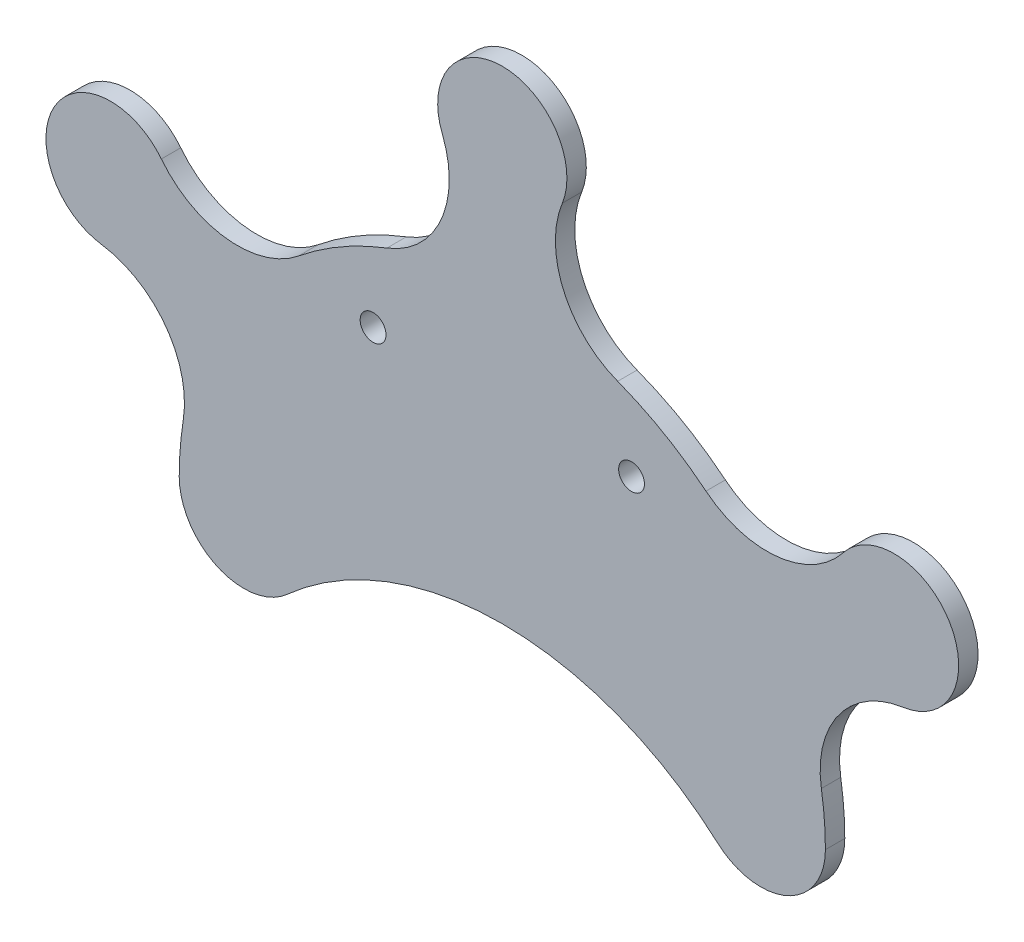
from build123d import *

# Parameters (mm, degrees)
SKETCH2_R      = 2
EXTRUDE1_DEPTH = 3


with BuildPart() as part:
    # Sketch2 → Extrude1 (new body)
    with BuildSketch(Plane.XY):
        with BuildLine():
            ThreePointArc((-17.855029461, 46.703296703), (-25, 43.301270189), (-31.518726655, 38.81455745))
            ThreePointArc((-31.518726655, 38.81455745), (-42.636750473, 35.551329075), (-52.76280482, 41.183569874))
            ThreePointArc((-52.76280482, 41.183569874), (-69.282032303, 40), (-62.047420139, 25.102144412))
            ThreePointArc((-62.047420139, 25.102144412), (-52.106729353, 19.148844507), (-49.373756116, 7.888739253))
            ThreePointArc((-49.373756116, 7.888739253), (-49.843193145, 3.956778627), (-50, 0))
            ThreePointArc((-50, 0), (-44.082482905, -9.128709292), (-33.333333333, -7.453559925))
            ThreePointArc((-33.333333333, -7.453559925), (0, 5.27864045), (33.333333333, -7.453559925))
            ThreePointArc((33.333333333, -7.453559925), (44.082482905, -9.128709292), (50, 0))
            ThreePointArc((50, 0), (49.843193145, 3.956778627), (49.373756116, 7.888739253))
            ThreePointArc((49.373756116, 7.888739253), (52.106729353, 19.148844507), (62.047420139, 25.102144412))
            ThreePointArc((62.047420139, 25.102144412), (69.282032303, 40), (52.76280482, 41.183569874))
            ThreePointArc((52.76280482, 41.183569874), (42.636750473, 35.551329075), (31.518726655, 38.81455745))
            ThreePointArc((31.518726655, 38.81455745), (25, 43.301270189), (17.855029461, 46.703296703))
            ThreePointArc((17.855029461, 46.703296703), (9.46997888, 54.700173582), (9.28461532, 66.285714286))
            ThreePointArc((9.28461532, 66.285714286), (0, 80), (-9.28461532, 66.285714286))
            ThreePointArc((-9.28461532, 66.285714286), (-9.46997888, 54.700173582), (-17.855029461, 46.703296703))
        make_face()
        with Locations((20, 35)):
            Circle(SKETCH2_R, mode=Mode.SUBTRACT)
        with Locations((-20, 35)):
            Circle(SKETCH2_R, mode=Mode.SUBTRACT)
    extrude(amount=EXTRUDE1_DEPTH)


solid = part.part
